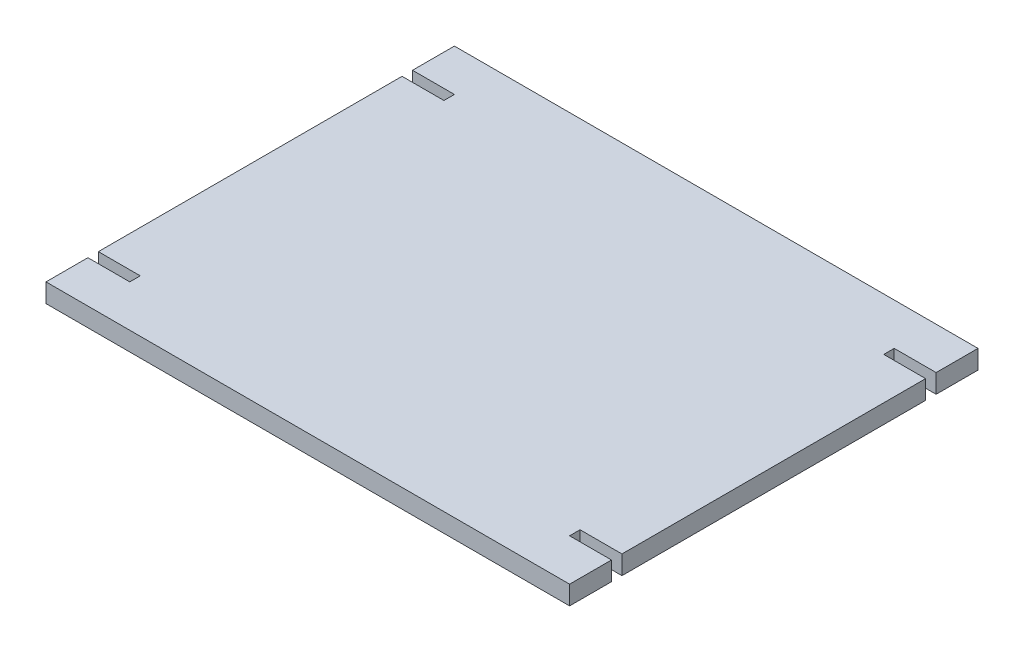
from build123d import *

# Parameters (mm, degrees)
BOSS_EXTRUDE1_DEPTH = 18


with BuildPart() as part:
    # Sketch1 → Boss-Extrude1 (new body)
    with BuildSketch(Plane(origin=(0, 0, 0), x_dir=(1, 0, 0), z_dir=(0, 1, 0))):
        Polygon((-301.875, 206.145833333), (198.125, 206.145833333), (198.125, 166.145833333), (158.125, 166.145833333), (158.125, 156.145833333), (198.125, 156.145833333), (198.125, -133.854166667), (158.125, -133.854166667), (158.125, -143.854166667), (198.125, -143.854166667), (198.125, -183.854166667), (-301.875, -183.854166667), (-301.875, -143.854166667), (-261.875, -143.854166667), (-261.875, -133.854166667), (-301.875, -133.854166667), (-301.875, 156.145833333), (-261.875, 156.145833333), (-261.875, 166.145833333), (-301.875, 166.145833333), align=None)
    extrude(amount=BOSS_EXTRUDE1_DEPTH)


solid = part.part
